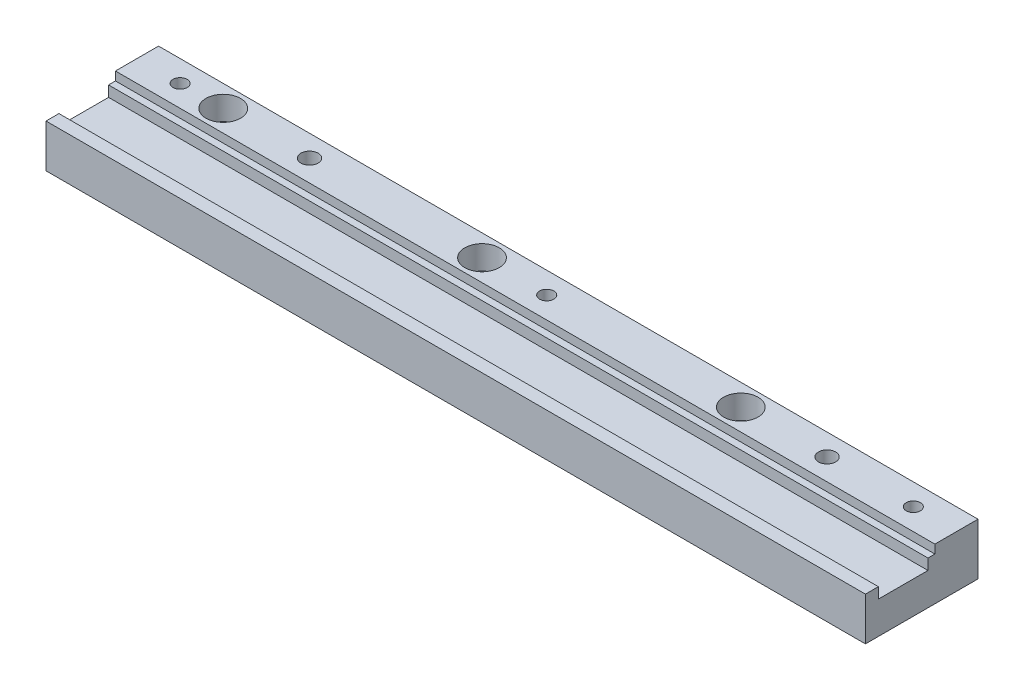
ISO-10303-21;
HEADER;
FILE_DESCRIPTION(('STEP AP214'),'2;1');
FILE_NAME('part.step','',(''),(''),'','','');
FILE_SCHEMA(('AUTOMOTIVE_DESIGN { 1 0 10303 214 1 1 1 1 }'));
ENDSEC;
DATA;
#1=APPLICATION_CONTEXT('core data for automotive mechanical design processes');
#2=APPLICATION_PROTOCOL_DEFINITION('international standard','automotive_design',2000,#1);
#3=PRODUCT_CONTEXT('',#1,'mechanical');
#4=PRODUCT('Part','Part','',(#3));
#5=PRODUCT_RELATED_PRODUCT_CATEGORY('part','',(#4));
#6=PRODUCT_DEFINITION_FORMATION('','',#4);
#7=PRODUCT_DEFINITION_CONTEXT('part definition',#1,'design');
#8=PRODUCT_DEFINITION('design','',#6,#7);
#9=PRODUCT_DEFINITION_SHAPE('','',#8);
#10=(LENGTH_UNIT() NAMED_UNIT(*) SI_UNIT(.MILLI.,.METRE.));
#11=(NAMED_UNIT(*) PLANE_ANGLE_UNIT() SI_UNIT($,.RADIAN.));
#12=(NAMED_UNIT(*) SI_UNIT($,.STERADIAN.) SOLID_ANGLE_UNIT());
#13=UNCERTAINTY_MEASURE_WITH_UNIT(LENGTH_MEASURE(1.E-05),#10,'distance_accuracy_value','');
#14=(GEOMETRIC_REPRESENTATION_CONTEXT(3) GLOBAL_UNCERTAINTY_ASSIGNED_CONTEXT((#13)) GLOBAL_UNIT_ASSIGNED_CONTEXT((#10,
#11,#12)) REPRESENTATION_CONTEXT('',''));
#15=CARTESIAN_POINT('',(0.,0.,0.));
#16=DIRECTION('',(0.,0.,1.));
#17=DIRECTION('',(1.,0.,0.));
#18=AXIS2_PLACEMENT_3D('',#15,#16,#17);
#19=CARTESIAN_POINT('',(80.,-14.0999999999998,5.));
#20=DIRECTION('',(0.,1.,0.));
#21=DIRECTION('',(0.,0.,1.));
#22=AXIS2_PLACEMENT_3D('',#19,#20,#21);
#23=CYLINDRICAL_SURFACE('',#22,2.25);
#24=CARTESIAN_POINT('',(80.,-1.14491749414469E-13,5.));
#25=DIRECTION('',(0.,1.,0.));
#26=DIRECTION('',(0.,0.,1.));
#27=AXIS2_PLACEMENT_3D('',#24,#25,#26);
#28=CIRCLE('',#27,2.25);
#29=CARTESIAN_POINT('',(80.,-1.14491749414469E-13,7.25));
#30=VERTEX_POINT('',#29);
#31=EDGE_CURVE('E119',#30,#30,#28,.T.);
#32=ORIENTED_EDGE('',*,*,#31,.F.);
#33=EDGE_LOOP('',(#32));
#34=FACE_BOUND('',#33,.T.);
#35=CARTESIAN_POINT('',(80.,6.50000000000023,5.));
#36=DIRECTION('',(0.,1.,0.));
#37=DIRECTION('',(0.,0.,1.));
#38=AXIS2_PLACEMENT_3D('',#35,#36,#37);
#39=CIRCLE('',#38,2.25);
#40=CARTESIAN_POINT('',(80.,6.50000000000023,7.25));
#41=VERTEX_POINT('',#40);
#42=EDGE_CURVE('E37',#41,#41,#39,.F.);
#43=ORIENTED_EDGE('',*,*,#42,.F.);
#44=EDGE_LOOP('',(#43));
#45=FACE_BOUND('',#44,.T.);
#46=ADVANCED_FACE('F33',(#34,#45),#23,.F.);
#47=CARTESIAN_POINT('',(20.0000000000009,-14.0999999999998,5.));
#48=DIRECTION('',(0.,1.,0.));
#49=DIRECTION('',(0.,0.,1.));
#50=AXIS2_PLACEMENT_3D('',#47,#48,#49);
#51=CYLINDRICAL_SURFACE('',#50,2.25);
#52=CARTESIAN_POINT('',(20.0000000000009,-1.14491749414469E-13,5.));
#53=DIRECTION('',(0.,1.,0.));
#54=DIRECTION('',(0.,0.,1.));
#55=AXIS2_PLACEMENT_3D('',#52,#53,#54);
#56=CIRCLE('',#55,2.25);
#57=CARTESIAN_POINT('',(20.0000000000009,-1.14491749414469E-13,7.25));
#58=VERTEX_POINT('',#57);
#59=EDGE_CURVE('E116',#58,#58,#56,.T.);
#60=ORIENTED_EDGE('',*,*,#59,.F.);
#61=EDGE_LOOP('',(#60));
#62=FACE_BOUND('',#61,.T.);
#63=CARTESIAN_POINT('',(20.0000000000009,6.50000000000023,5.));
#64=DIRECTION('',(0.,1.,0.));
#65=DIRECTION('',(0.,0.,1.));
#66=AXIS2_PLACEMENT_3D('',#63,#64,#65);
#67=CIRCLE('',#66,2.25);
#68=CARTESIAN_POINT('',(20.0000000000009,6.50000000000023,7.25));
#69=VERTEX_POINT('',#68);
#70=EDGE_CURVE('E145',#69,#69,#67,.F.);
#71=ORIENTED_EDGE('',*,*,#70,.F.);
#72=EDGE_LOOP('',(#71));
#73=FACE_BOUND('',#72,.T.);
#74=ADVANCED_FACE('F294',(#62,#73),#51,.F.);
#75=CARTESIAN_POINT('',(140.,-14.0999999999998,5.));
#76=DIRECTION('',(0.,1.,0.));
#77=DIRECTION('',(0.,0.,1.));
#78=AXIS2_PLACEMENT_3D('',#75,#76,#77);
#79=CYLINDRICAL_SURFACE('',#78,2.25);
#80=CARTESIAN_POINT('',(140.,-1.14491749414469E-13,5.));
#81=DIRECTION('',(0.,1.,0.));
#82=DIRECTION('',(0.,0.,1.));
#83=AXIS2_PLACEMENT_3D('',#80,#81,#82);
#84=CIRCLE('',#83,2.25);
#85=CARTESIAN_POINT('',(140.,-1.14491749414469E-13,7.25));
#86=VERTEX_POINT('',#85);
#87=EDGE_CURVE('E112',#86,#86,#84,.T.);
#88=ORIENTED_EDGE('',*,*,#87,.F.);
#89=EDGE_LOOP('',(#88));
#90=FACE_BOUND('',#89,.T.);
#91=CARTESIAN_POINT('',(140.,6.50000000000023,5.));
#92=DIRECTION('',(0.,1.,0.));
#93=DIRECTION('',(0.,0.,1.));
#94=AXIS2_PLACEMENT_3D('',#91,#92,#93);
#95=CIRCLE('',#94,2.25);
#96=CARTESIAN_POINT('',(140.,6.50000000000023,7.25));
#97=VERTEX_POINT('',#96);
#98=EDGE_CURVE('E142',#97,#97,#95,.F.);
#99=ORIENTED_EDGE('',*,*,#98,.F.);
#100=EDGE_LOOP('',(#99));
#101=FACE_BOUND('',#100,.T.);
#102=ADVANCED_FACE('F300',(#90,#101),#79,.F.);
#103=CARTESIAN_POINT('',(190.,-1.13686837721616E-13,26.1));
#104=DIRECTION('',(-1.,0.,0.));
#105=DIRECTION('',(0.,0.,1.));
#106=AXIS2_PLACEMENT_3D('',#103,#104,#105);
#107=PLANE('',#106);
#108=DIRECTION('',(0.,-1.,0.));
#109=VECTOR('',#108,1.);
#110=CARTESIAN_POINT('',(190.,9.99999999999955,10.));
#111=LINE('',#110,#109);
#112=CARTESIAN_POINT('',(190.,12.,10.));
#113=VERTEX_POINT('',#112);
#114=CARTESIAN_POINT('',(190.,9.99999999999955,10.));
#115=VERTEX_POINT('',#114);
#116=EDGE_CURVE('E199',#113,#115,#111,.T.);
#117=ORIENTED_EDGE('',*,*,#116,.T.);
#118=DIRECTION('',(0.,0.,1.));
#119=VECTOR('',#118,1.);
#120=CARTESIAN_POINT('',(190.,9.99999999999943,11.6000000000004));
#121=LINE('',#120,#119);
#122=CARTESIAN_POINT('',(190.,9.99999999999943,11.6000000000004));
#123=VERTEX_POINT('',#122);
#124=EDGE_CURVE('E202',#115,#123,#121,.T.);
#125=ORIENTED_EDGE('',*,*,#124,.T.);
#126=DIRECTION('',(0.,-1.,0.));
#127=VECTOR('',#126,1.);
#128=CARTESIAN_POINT('',(190.,7.49999999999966,11.6000000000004));
#129=LINE('',#128,#127);
#130=CARTESIAN_POINT('',(190.,7.49999999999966,11.6000000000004));
#131=VERTEX_POINT('',#130);
#132=EDGE_CURVE('E205',#123,#131,#129,.T.);
#133=ORIENTED_EDGE('',*,*,#132,.T.);
#134=DIRECTION('',(0.,0.,1.));
#135=VECTOR('',#134,1.);
#136=CARTESIAN_POINT('',(190.,7.49999999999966,23.1000000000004));
#137=LINE('',#136,#135);
#138=CARTESIAN_POINT('',(190.,7.49999999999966,23.1000000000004));
#139=VERTEX_POINT('',#138);
#140=EDGE_CURVE('E179',#131,#139,#137,.T.);
#141=ORIENTED_EDGE('',*,*,#140,.T.);
#142=DIRECTION('',(0.,1.,0.));
#143=VECTOR('',#142,1.);
#144=CARTESIAN_POINT('',(190.,7.49999999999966,23.1000000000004));
#145=LINE('',#144,#143);
#146=CARTESIAN_POINT('',(190.,10.,23.1000000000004));
#147=VERTEX_POINT('',#146);
#148=EDGE_CURVE('E115',#139,#147,#145,.T.);
#149=ORIENTED_EDGE('',*,*,#148,.T.);
#150=DIRECTION('',(0.,0.,1.));
#151=VECTOR('',#150,1.);
#152=CARTESIAN_POINT('',(190.,10.,26.1000000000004));
#153=LINE('',#152,#151);
#154=CARTESIAN_POINT('',(190.,10.,26.1000000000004));
#155=VERTEX_POINT('',#154);
#156=EDGE_CURVE('E196',#147,#155,#153,.T.);
#157=ORIENTED_EDGE('',*,*,#156,.T.);
#158=DIRECTION('',(0.,1.,0.));
#159=VECTOR('',#158,1.);
#160=CARTESIAN_POINT('',(190.,-1.13686837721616E-13,26.1));
#161=LINE('',#160,#159);
#162=CARTESIAN_POINT('',(190.,-1.13686837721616E-13,26.1));
#163=VERTEX_POINT('',#162);
#164=EDGE_CURVE('E225',#163,#155,#161,.T.);
#165=ORIENTED_EDGE('',*,*,#164,.F.);
#166=DIRECTION('',(0.,0.,-1.));
#167=VECTOR('',#166,1.);
#168=CARTESIAN_POINT('',(190.,-1.13686837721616E-13,26.1));
#169=LINE('',#168,#167);
#170=CARTESIAN_POINT('',(190.,-1.13686837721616E-13,0.));
#171=VERTEX_POINT('',#170);
#172=EDGE_CURVE('E12',#163,#171,#169,.T.);
#173=ORIENTED_EDGE('',*,*,#172,.T.);
#174=DIRECTION('',(0.,1.,0.));
#175=VECTOR('',#174,1.);
#176=CARTESIAN_POINT('',(190.,-1.13686837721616E-13,0.));
#177=LINE('',#176,#175);
#178=CARTESIAN_POINT('',(190.,12.0000000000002,0.));
#179=VERTEX_POINT('',#178);
#180=EDGE_CURVE('E99',#171,#179,#177,.T.);
#181=ORIENTED_EDGE('',*,*,#180,.T.);
#182=DIRECTION('',(0.,0.,-1.));
#183=VECTOR('',#182,1.);
#184=CARTESIAN_POINT('',(190.,12.0000000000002,26.1));
#185=LINE('',#184,#183);
#186=EDGE_CURVE('E42',#113,#179,#185,.T.);
#187=ORIENTED_EDGE('',*,*,#186,.F.);
#188=EDGE_LOOP('',(#117,#125,#133,#141,#149,#157,#165,#173,#181,#187));
#189=FACE_BOUND('',#188,.T.);
#190=ADVANCED_FACE('F232',(#189),#107,.F.);
#191=CARTESIAN_POINT('',(0.,12.0000000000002,26.1));
#192=DIRECTION('',(0.,-1.,0.));
#193=DIRECTION('',(0.,0.,-1.));
#194=AXIS2_PLACEMENT_3D('',#191,#192,#193);
#195=PLANE('',#194);
#196=CARTESIAN_POINT('',(80.,12.0000000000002,5.));
#197=DIRECTION('',(0.,1.,0.));
#198=DIRECTION('',(0.,0.,1.));
#199=AXIS2_PLACEMENT_3D('',#196,#197,#198);
#200=CIRCLE('',#199,4.);
#201=CARTESIAN_POINT('',(80.,12.0000000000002,9.00000000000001));
#202=VERTEX_POINT('',#201);
#203=EDGE_CURVE('E161',#202,#202,#200,.T.);
#204=ORIENTED_EDGE('',*,*,#203,.F.);
#205=EDGE_LOOP('',(#204));
#206=FACE_BOUND('',#205,.T.);
#207=CARTESIAN_POINT('',(20.0000000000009,12.0000000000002,5.));
#208=DIRECTION('',(0.,1.,0.));
#209=DIRECTION('',(0.,0.,1.));
#210=AXIS2_PLACEMENT_3D('',#207,#208,#209);
#211=CIRCLE('',#210,4.);
#212=CARTESIAN_POINT('',(20.0000000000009,12.0000000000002,9.));
#213=VERTEX_POINT('',#212);
#214=EDGE_CURVE('E154',#213,#213,#211,.T.);
#215=ORIENTED_EDGE('',*,*,#214,.F.);
#216=EDGE_LOOP('',(#215));
#217=FACE_BOUND('',#216,.T.);
#218=CARTESIAN_POINT('',(140.,12.0000000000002,5.));
#219=DIRECTION('',(0.,1.,0.));
#220=DIRECTION('',(0.,0.,1.));
#221=AXIS2_PLACEMENT_3D('',#218,#219,#220);
#222=CIRCLE('',#221,4.);
#223=CARTESIAN_POINT('',(140.,12.0000000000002,9.00000000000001));
#224=VERTEX_POINT('',#223);
#225=EDGE_CURVE('E147',#224,#224,#222,.T.);
#226=ORIENTED_EDGE('',*,*,#225,.F.);
#227=EDGE_LOOP('',(#226));
#228=FACE_BOUND('',#227,.T.);
#229=CARTESIAN_POINT('',(40.,12.0000000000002,5.));
#230=DIRECTION('',(0.,1.,0.));
#231=DIRECTION('',(0.,0.,1.));
#232=AXIS2_PLACEMENT_3D('',#229,#230,#231);
#233=CIRCLE('',#232,2.00000000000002);
#234=CARTESIAN_POINT('',(40.,12.0000000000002,7.00000000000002));
#235=VERTEX_POINT('',#234);
#236=EDGE_CURVE('E141',#235,#235,#233,.T.);
#237=ORIENTED_EDGE('',*,*,#236,.F.);
#238=EDGE_LOOP('',(#237));
#239=FACE_BOUND('',#238,.T.);
#240=CARTESIAN_POINT('',(160.,12.0000000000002,5.));
#241=DIRECTION('',(0.,1.,0.));
#242=DIRECTION('',(0.,0.,1.));
#243=AXIS2_PLACEMENT_3D('',#240,#241,#242);
#244=CIRCLE('',#243,2.00000000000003);
#245=CARTESIAN_POINT('',(160.,12.0000000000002,7.00000000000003));
#246=VERTEX_POINT('',#245);
#247=EDGE_CURVE('E137',#246,#246,#244,.T.);
#248=ORIENTED_EDGE('',*,*,#247,.F.);
#249=EDGE_LOOP('',(#248));
#250=FACE_BOUND('',#249,.T.);
#251=CARTESIAN_POINT('',(180.000000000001,12.0000000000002,5.));
#252=DIRECTION('',(0.,1.,0.));
#253=DIRECTION('',(0.,0.,1.));
#254=AXIS2_PLACEMENT_3D('',#251,#252,#253);
#255=CIRCLE('',#254,1.65000000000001);
#256=CARTESIAN_POINT('',(180.000000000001,12.0000000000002,6.65000000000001));
#257=VERTEX_POINT('',#256);
#258=EDGE_CURVE('E133',#257,#257,#255,.T.);
#259=ORIENTED_EDGE('',*,*,#258,.F.);
#260=EDGE_LOOP('',(#259));
#261=FACE_BOUND('',#260,.T.);
#262=CARTESIAN_POINT('',(95.,12.0000000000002,5.));
#263=DIRECTION('',(0.,1.,0.));
#264=DIRECTION('',(0.,0.,1.));
#265=AXIS2_PLACEMENT_3D('',#262,#263,#264);
#266=CIRCLE('',#265,1.65);
#267=CARTESIAN_POINT('',(95.,12.0000000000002,6.65));
#268=VERTEX_POINT('',#267);
#269=EDGE_CURVE('E129',#268,#268,#266,.T.);
#270=ORIENTED_EDGE('',*,*,#269,.F.);
#271=EDGE_LOOP('',(#270));
#272=FACE_BOUND('',#271,.T.);
#273=CARTESIAN_POINT('',(10.0000000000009,12.0000000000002,5.));
#274=DIRECTION('',(0.,1.,0.));
#275=DIRECTION('',(0.,0.,1.));
#276=AXIS2_PLACEMENT_3D('',#273,#274,#275);
#277=CIRCLE('',#276,1.65);
#278=CARTESIAN_POINT('',(10.0000000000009,12.0000000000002,6.65));
#279=VERTEX_POINT('',#278);
#280=EDGE_CURVE('E125',#279,#279,#277,.T.);
#281=ORIENTED_EDGE('',*,*,#280,.F.);
#282=EDGE_LOOP('',(#281));
#283=FACE_BOUND('',#282,.T.);
#284=DIRECTION('',(1.,0.,0.));
#285=VECTOR('',#284,1.);
#286=CARTESIAN_POINT('',(0.,12.,10.));
#287=LINE('',#286,#285);
#288=CARTESIAN_POINT('',(0.,12.,10.));
#289=VERTEX_POINT('',#288);
#290=EDGE_CURVE('E218',#289,#113,#287,.T.);
#291=ORIENTED_EDGE('',*,*,#290,.T.);
#292=ORIENTED_EDGE('',*,*,#186,.T.);
#293=DIRECTION('',(-1.,0.,0.));
#294=VECTOR('',#293,1.);
#295=CARTESIAN_POINT('',(0.,12.0000000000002,0.));
#296=LINE('',#295,#294);
#297=CARTESIAN_POINT('',(0.,12.0000000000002,0.));
#298=VERTEX_POINT('',#297);
#299=EDGE_CURVE('E90',#179,#298,#296,.T.);
#300=ORIENTED_EDGE('',*,*,#299,.T.);
#301=DIRECTION('',(0.,0.,-1.));
#302=VECTOR('',#301,1.);
#303=CARTESIAN_POINT('',(0.,12.0000000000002,26.1));
#304=LINE('',#303,#302);
#305=EDGE_CURVE('E84',#289,#298,#304,.T.);
#306=ORIENTED_EDGE('',*,*,#305,.F.);
#307=EDGE_LOOP('',(#291,#292,#300,#306));
#308=FACE_BOUND('',#307,.T.);
#309=ADVANCED_FACE('F270',(#206,#217,#228,#239,#250,#261,#272,#283,#308),#195,.F.);
#310=CARTESIAN_POINT('',(0.,-1.13686837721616E-13,26.1));
#311=DIRECTION('',(1.,0.,0.));
#312=DIRECTION('',(0.,0.,-1.));
#313=AXIS2_PLACEMENT_3D('',#310,#311,#312);
#314=PLANE('',#313);
#315=DIRECTION('',(0.,-1.,0.));
#316=VECTOR('',#315,1.);
#317=CARTESIAN_POINT('',(0.,9.99999999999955,10.));
#318=LINE('',#317,#316);
#319=CARTESIAN_POINT('',(0.,9.99999999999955,10.));
#320=VERTEX_POINT('',#319);
#321=EDGE_CURVE('E181',#289,#320,#318,.T.);
#322=ORIENTED_EDGE('',*,*,#321,.F.);
#323=ORIENTED_EDGE('',*,*,#305,.T.);
#324=DIRECTION('',(0.,-1.,0.));
#325=VECTOR('',#324,1.);
#326=CARTESIAN_POINT('',(0.,-1.13686837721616E-13,0.));
#327=LINE('',#326,#325);
#328=CARTESIAN_POINT('',(0.,-1.13686837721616E-13,0.));
#329=VERTEX_POINT('',#328);
#330=EDGE_CURVE('E77',#298,#329,#327,.T.);
#331=ORIENTED_EDGE('',*,*,#330,.T.);
#332=DIRECTION('',(0.,0.,-1.));
#333=VECTOR('',#332,1.);
#334=CARTESIAN_POINT('',(0.,-1.13686837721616E-13,26.1));
#335=LINE('',#334,#333);
#336=CARTESIAN_POINT('',(0.,-1.13686837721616E-13,26.1));
#337=VERTEX_POINT('',#336);
#338=EDGE_CURVE('E81',#337,#329,#335,.T.);
#339=ORIENTED_EDGE('',*,*,#338,.F.);
#340=DIRECTION('',(0.,-1.,0.));
#341=VECTOR('',#340,1.);
#342=CARTESIAN_POINT('',(0.,-1.13686837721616E-13,26.1));
#343=LINE('',#342,#341);
#344=CARTESIAN_POINT('',(0.,10.,26.1));
#345=VERTEX_POINT('',#344);
#346=EDGE_CURVE('E58',#345,#337,#343,.T.);
#347=ORIENTED_EDGE('',*,*,#346,.F.);
#348=DIRECTION('',(0.,0.,1.));
#349=VECTOR('',#348,1.);
#350=CARTESIAN_POINT('',(0.,10.,26.1000000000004));
#351=LINE('',#350,#349);
#352=CARTESIAN_POINT('',(0.,10.,23.1000000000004));
#353=VERTEX_POINT('',#352);
#354=EDGE_CURVE('E50',#353,#345,#351,.T.);
#355=ORIENTED_EDGE('',*,*,#354,.F.);
#356=DIRECTION('',(0.,1.,0.));
#357=VECTOR('',#356,1.);
#358=CARTESIAN_POINT('',(0.,7.49999999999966,23.1000000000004));
#359=LINE('',#358,#357);
#360=CARTESIAN_POINT('',(0.,7.49999999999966,23.1000000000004));
#361=VERTEX_POINT('',#360);
#362=EDGE_CURVE('E176',#361,#353,#359,.T.);
#363=ORIENTED_EDGE('',*,*,#362,.F.);
#364=DIRECTION('',(0.,0.,1.));
#365=VECTOR('',#364,1.);
#366=CARTESIAN_POINT('',(0.,7.49999999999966,23.1000000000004));
#367=LINE('',#366,#365);
#368=CARTESIAN_POINT('',(0.,7.49999999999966,11.6000000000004));
#369=VERTEX_POINT('',#368);
#370=EDGE_CURVE('E190',#369,#361,#367,.T.);
#371=ORIENTED_EDGE('',*,*,#370,.F.);
#372=DIRECTION('',(0.,-1.,0.));
#373=VECTOR('',#372,1.);
#374=CARTESIAN_POINT('',(0.,7.49999999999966,11.6000000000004));
#375=LINE('',#374,#373);
#376=CARTESIAN_POINT('',(0.,9.99999999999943,11.6000000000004));
#377=VERTEX_POINT('',#376);
#378=EDGE_CURVE('E187',#377,#369,#375,.T.);
#379=ORIENTED_EDGE('',*,*,#378,.F.);
#380=DIRECTION('',(0.,0.,1.));
#381=VECTOR('',#380,1.);
#382=CARTESIAN_POINT('',(0.,9.99999999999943,11.6000000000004));
#383=LINE('',#382,#381);
#384=EDGE_CURVE('E184',#320,#377,#383,.T.);
#385=ORIENTED_EDGE('',*,*,#384,.F.);
#386=EDGE_LOOP('',(#322,#323,#331,#339,#347,#355,#363,#371,#379,#385));
#387=FACE_BOUND('',#386,.T.);
#388=ADVANCED_FACE('F80',(#387),#314,.F.);
#389=CARTESIAN_POINT('',(190.,-1.13686837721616E-13,26.1));
#390=DIRECTION('',(0.,0.,1.));
#391=DIRECTION('',(1.,0.,0.));
#392=AXIS2_PLACEMENT_3D('',#389,#390,#391);
#393=PLANE('',#392);
#394=ORIENTED_EDGE('',*,*,#164,.T.);
#395=DIRECTION('',(1.,0.,0.));
#396=VECTOR('',#395,1.);
#397=CARTESIAN_POINT('',(0.,10.,26.1000000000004));
#398=LINE('',#397,#396);
#399=EDGE_CURVE('E221',#345,#155,#398,.T.);
#400=ORIENTED_EDGE('',*,*,#399,.F.);
#401=ORIENTED_EDGE('',*,*,#346,.T.);
#402=DIRECTION('',(1.,0.,0.));
#403=VECTOR('',#402,1.);
#404=CARTESIAN_POINT('',(0.,-1.13686837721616E-13,26.1));
#405=LINE('',#404,#403);
#406=EDGE_CURVE('E89',#337,#163,#405,.T.);
#407=ORIENTED_EDGE('',*,*,#406,.T.);
#408=EDGE_LOOP('',(#394,#400,#401,#407));
#409=FACE_BOUND('',#408,.T.);
#410=ADVANCED_FACE('F228',(#409),#393,.T.);
#411=CARTESIAN_POINT('',(0.,-1.13686837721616E-13,26.1));
#412=DIRECTION('',(0.,1.,0.));
#413=DIRECTION('',(0.,0.,1.));
#414=AXIS2_PLACEMENT_3D('',#411,#412,#413);
#415=PLANE('',#414);
#416=CARTESIAN_POINT('',(40.,-1.14491749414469E-13,5.));
#417=DIRECTION('',(0.,1.,0.));
#418=DIRECTION('',(0.,0.,1.));
#419=AXIS2_PLACEMENT_3D('',#416,#417,#418);
#420=CIRCLE('',#419,2.00000000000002);
#421=CARTESIAN_POINT('',(40.,-1.14491749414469E-13,7.00000000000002));
#422=VERTEX_POINT('',#421);
#423=EDGE_CURVE('E138',#422,#422,#420,.T.);
#424=ORIENTED_EDGE('',*,*,#423,.T.);
#425=EDGE_LOOP('',(#424));
#426=FACE_BOUND('',#425,.T.);
#427=CARTESIAN_POINT('',(160.,-1.14491749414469E-13,5.));
#428=DIRECTION('',(0.,1.,0.));
#429=DIRECTION('',(0.,0.,1.));
#430=AXIS2_PLACEMENT_3D('',#427,#428,#429);
#431=CIRCLE('',#430,2.00000000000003);
#432=CARTESIAN_POINT('',(160.,-1.14491749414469E-13,7.00000000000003));
#433=VERTEX_POINT('',#432);
#434=EDGE_CURVE('E134',#433,#433,#431,.T.);
#435=ORIENTED_EDGE('',*,*,#434,.T.);
#436=EDGE_LOOP('',(#435));
#437=FACE_BOUND('',#436,.T.);
#438=CARTESIAN_POINT('',(180.000000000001,-1.14491749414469E-13,5.));
#439=DIRECTION('',(0.,1.,0.));
#440=DIRECTION('',(0.,0.,1.));
#441=AXIS2_PLACEMENT_3D('',#438,#439,#440);
#442=CIRCLE('',#441,1.65000000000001);
#443=CARTESIAN_POINT('',(180.000000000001,-1.14491749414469E-13,6.65000000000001));
#444=VERTEX_POINT('',#443);
#445=EDGE_CURVE('E130',#444,#444,#442,.T.);
#446=ORIENTED_EDGE('',*,*,#445,.T.);
#447=EDGE_LOOP('',(#446));
#448=FACE_BOUND('',#447,.T.);
#449=CARTESIAN_POINT('',(95.,-1.14491749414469E-13,5.));
#450=DIRECTION('',(0.,1.,0.));
#451=DIRECTION('',(0.,0.,1.));
#452=AXIS2_PLACEMENT_3D('',#449,#450,#451);
#453=CIRCLE('',#452,1.65);
#454=CARTESIAN_POINT('',(95.,-1.14491749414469E-13,6.65));
#455=VERTEX_POINT('',#454);
#456=EDGE_CURVE('E126',#455,#455,#453,.T.);
#457=ORIENTED_EDGE('',*,*,#456,.T.);
#458=EDGE_LOOP('',(#457));
#459=FACE_BOUND('',#458,.T.);
#460=CARTESIAN_POINT('',(10.0000000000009,-1.14491749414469E-13,5.));
#461=DIRECTION('',(0.,1.,0.));
#462=DIRECTION('',(0.,0.,1.));
#463=AXIS2_PLACEMENT_3D('',#460,#461,#462);
#464=CIRCLE('',#463,1.65);
#465=CARTESIAN_POINT('',(10.0000000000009,-1.14491749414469E-13,6.65));
#466=VERTEX_POINT('',#465);
#467=EDGE_CURVE('E122',#466,#466,#464,.T.);
#468=ORIENTED_EDGE('',*,*,#467,.T.);
#469=EDGE_LOOP('',(#468));
#470=FACE_BOUND('',#469,.T.);
#471=ORIENTED_EDGE('',*,*,#31,.T.);
#472=EDGE_LOOP('',(#471));
#473=FACE_BOUND('',#472,.T.);
#474=ORIENTED_EDGE('',*,*,#59,.T.);
#475=EDGE_LOOP('',(#474));
#476=FACE_BOUND('',#475,.T.);
#477=ORIENTED_EDGE('',*,*,#87,.T.);
#478=EDGE_LOOP('',(#477));
#479=FACE_BOUND('',#478,.T.);
#480=DIRECTION('',(1.,0.,0.));
#481=VECTOR('',#480,1.);
#482=CARTESIAN_POINT('',(0.,-1.13686837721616E-13,0.));
#483=LINE('',#482,#481);
#484=EDGE_CURVE('E95',#329,#171,#483,.T.);
#485=ORIENTED_EDGE('',*,*,#484,.T.);
#486=ORIENTED_EDGE('',*,*,#172,.F.);
#487=ORIENTED_EDGE('',*,*,#406,.F.);
#488=ORIENTED_EDGE('',*,*,#338,.T.);
#489=EDGE_LOOP('',(#485,#486,#487,#488));
#490=FACE_BOUND('',#489,.T.);
#491=ADVANCED_FACE('F35',(#426,#437,#448,#459,#470,#473,#476,#479,#490),#415,.F.);
#492=CARTESIAN_POINT('',(190.,-1.13686837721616E-13,0.));
#493=DIRECTION('',(0.,0.,1.));
#494=DIRECTION('',(1.,0.,0.));
#495=AXIS2_PLACEMENT_3D('',#492,#493,#494);
#496=PLANE('',#495);
#497=ORIENTED_EDGE('',*,*,#484,.F.);
#498=ORIENTED_EDGE('',*,*,#330,.F.);
#499=ORIENTED_EDGE('',*,*,#299,.F.);
#500=ORIENTED_EDGE('',*,*,#180,.F.);
#501=EDGE_LOOP('',(#497,#498,#499,#500));
#502=FACE_BOUND('',#501,.T.);
#503=ADVANCED_FACE('F97',(#502),#496,.F.);
#504=CARTESIAN_POINT('',(0.,7.49999999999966,23.1000000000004));
#505=DIRECTION('',(0.,0.,-1.));
#506=DIRECTION('',(-1.,0.,0.));
#507=AXIS2_PLACEMENT_3D('',#504,#505,#506);
#508=PLANE('',#507);
#509=ORIENTED_EDGE('',*,*,#148,.F.);
#510=DIRECTION('',(1.,0.,0.));
#511=VECTOR('',#510,1.);
#512=CARTESIAN_POINT('',(0.,7.49999999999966,23.1000000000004));
#513=LINE('',#512,#511);
#514=EDGE_CURVE('E100',#361,#139,#513,.T.);
#515=ORIENTED_EDGE('',*,*,#514,.F.);
#516=ORIENTED_EDGE('',*,*,#362,.T.);
#517=DIRECTION('',(1.,0.,0.));
#518=VECTOR('',#517,1.);
#519=CARTESIAN_POINT('',(0.,10.,23.1000000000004));
#520=LINE('',#519,#518);
#521=EDGE_CURVE('E193',#353,#147,#520,.T.);
#522=ORIENTED_EDGE('',*,*,#521,.T.);
#523=EDGE_LOOP('',(#509,#515,#516,#522));
#524=FACE_BOUND('',#523,.T.);
#525=ADVANCED_FACE('F282',(#524),#508,.T.);
#526=CARTESIAN_POINT('',(0.,7.49999999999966,23.1000000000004));
#527=DIRECTION('',(0.,1.,0.));
#528=DIRECTION('',(0.,0.,1.));
#529=AXIS2_PLACEMENT_3D('',#526,#527,#528);
#530=PLANE('',#529);
#531=ORIENTED_EDGE('',*,*,#140,.F.);
#532=DIRECTION('',(1.,0.,0.));
#533=VECTOR('',#532,1.);
#534=CARTESIAN_POINT('',(0.,7.49999999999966,11.6000000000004));
#535=LINE('',#534,#533);
#536=EDGE_CURVE('E104',#369,#131,#535,.T.);
#537=ORIENTED_EDGE('',*,*,#536,.F.);
#538=ORIENTED_EDGE('',*,*,#370,.T.);
#539=ORIENTED_EDGE('',*,*,#514,.T.);
#540=EDGE_LOOP('',(#531,#537,#538,#539));
#541=FACE_BOUND('',#540,.T.);
#542=ADVANCED_FACE('F280',(#541),#530,.T.);
#543=CARTESIAN_POINT('',(0.,7.49999999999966,11.6000000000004));
#544=DIRECTION('',(0.,0.,1.));
#545=DIRECTION('',(1.,0.,0.));
#546=AXIS2_PLACEMENT_3D('',#543,#544,#545);
#547=PLANE('',#546);
#548=ORIENTED_EDGE('',*,*,#132,.F.);
#549=DIRECTION('',(1.,0.,0.));
#550=VECTOR('',#549,1.);
#551=CARTESIAN_POINT('',(0.,9.99999999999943,11.6000000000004));
#552=LINE('',#551,#550);
#553=EDGE_CURVE('E212',#377,#123,#552,.T.);
#554=ORIENTED_EDGE('',*,*,#553,.F.);
#555=ORIENTED_EDGE('',*,*,#378,.T.);
#556=ORIENTED_EDGE('',*,*,#536,.T.);
#557=EDGE_LOOP('',(#548,#554,#555,#556));
#558=FACE_BOUND('',#557,.T.);
#559=ADVANCED_FACE('F276',(#558),#547,.T.);
#560=CARTESIAN_POINT('',(0.,9.99999999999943,11.6000000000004));
#561=DIRECTION('',(0.,1.,0.));
#562=DIRECTION('',(0.,0.,1.));
#563=AXIS2_PLACEMENT_3D('',#560,#561,#562);
#564=PLANE('',#563);
#565=ORIENTED_EDGE('',*,*,#124,.F.);
#566=DIRECTION('',(1.,0.,0.));
#567=VECTOR('',#566,1.);
#568=CARTESIAN_POINT('',(0.,9.99999999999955,10.));
#569=LINE('',#568,#567);
#570=EDGE_CURVE('E215',#320,#115,#569,.T.);
#571=ORIENTED_EDGE('',*,*,#570,.F.);
#572=ORIENTED_EDGE('',*,*,#384,.T.);
#573=ORIENTED_EDGE('',*,*,#553,.T.);
#574=EDGE_LOOP('',(#565,#571,#572,#573));
#575=FACE_BOUND('',#574,.T.);
#576=ADVANCED_FACE('F274',(#575),#564,.T.);
#577=CARTESIAN_POINT('',(0.,9.99999999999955,10.));
#578=DIRECTION('',(0.,0.,1.));
#579=DIRECTION('',(1.,0.,0.));
#580=AXIS2_PLACEMENT_3D('',#577,#578,#579);
#581=PLANE('',#580);
#582=ORIENTED_EDGE('',*,*,#116,.F.);
#583=ORIENTED_EDGE('',*,*,#290,.F.);
#584=ORIENTED_EDGE('',*,*,#321,.T.);
#585=ORIENTED_EDGE('',*,*,#570,.T.);
#586=EDGE_LOOP('',(#582,#583,#584,#585));
#587=FACE_BOUND('',#586,.T.);
#588=ADVANCED_FACE('F265',(#587),#581,.T.);
#589=CARTESIAN_POINT('',(0.,10.,26.1000000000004));
#590=DIRECTION('',(0.,1.,0.));
#591=DIRECTION('',(0.,0.,1.));
#592=AXIS2_PLACEMENT_3D('',#589,#590,#591);
#593=PLANE('',#592);
#594=ORIENTED_EDGE('',*,*,#156,.F.);
#595=ORIENTED_EDGE('',*,*,#521,.F.);
#596=ORIENTED_EDGE('',*,*,#354,.T.);
#597=ORIENTED_EDGE('',*,*,#399,.T.);
#598=EDGE_LOOP('',(#594,#595,#596,#597));
#599=FACE_BOUND('',#598,.T.);
#600=ADVANCED_FACE('F235',(#599),#593,.T.);
#601=CARTESIAN_POINT('',(10.0000000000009,-14.0999999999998,5.));
#602=DIRECTION('',(0.,1.,0.));
#603=DIRECTION('',(0.,0.,1.));
#604=AXIS2_PLACEMENT_3D('',#601,#602,#603);
#605=CYLINDRICAL_SURFACE('',#604,1.65);
#606=ORIENTED_EDGE('',*,*,#280,.T.);
#607=EDGE_LOOP('',(#606));
#608=FACE_BOUND('',#607,.T.);
#609=ORIENTED_EDGE('',*,*,#467,.F.);
#610=EDGE_LOOP('',(#609));
#611=FACE_BOUND('',#610,.T.);
#612=ADVANCED_FACE('F306',(#608,#611),#605,.F.);
#613=CARTESIAN_POINT('',(95.,-14.0999999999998,5.));
#614=DIRECTION('',(0.,1.,0.));
#615=DIRECTION('',(0.,0.,1.));
#616=AXIS2_PLACEMENT_3D('',#613,#614,#615);
#617=CYLINDRICAL_SURFACE('',#616,1.65);
#618=ORIENTED_EDGE('',*,*,#269,.T.);
#619=EDGE_LOOP('',(#618));
#620=FACE_BOUND('',#619,.T.);
#621=ORIENTED_EDGE('',*,*,#456,.F.);
#622=EDGE_LOOP('',(#621));
#623=FACE_BOUND('',#622,.T.);
#624=ADVANCED_FACE('F321',(#620,#623),#617,.F.);
#625=CARTESIAN_POINT('',(180.000000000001,-14.0999999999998,5.));
#626=DIRECTION('',(0.,1.,0.));
#627=DIRECTION('',(0.,0.,1.));
#628=AXIS2_PLACEMENT_3D('',#625,#626,#627);
#629=CYLINDRICAL_SURFACE('',#628,1.65000000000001);
#630=ORIENTED_EDGE('',*,*,#258,.T.);
#631=EDGE_LOOP('',(#630));
#632=FACE_BOUND('',#631,.T.);
#633=ORIENTED_EDGE('',*,*,#445,.F.);
#634=EDGE_LOOP('',(#633));
#635=FACE_BOUND('',#634,.T.);
#636=ADVANCED_FACE('F326',(#632,#635),#629,.F.);
#637=CARTESIAN_POINT('',(160.,-14.0999999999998,5.));
#638=DIRECTION('',(0.,1.,0.));
#639=DIRECTION('',(0.,0.,1.));
#640=AXIS2_PLACEMENT_3D('',#637,#638,#639);
#641=CYLINDRICAL_SURFACE('',#640,2.00000000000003);
#642=ORIENTED_EDGE('',*,*,#247,.T.);
#643=EDGE_LOOP('',(#642));
#644=FACE_BOUND('',#643,.T.);
#645=ORIENTED_EDGE('',*,*,#434,.F.);
#646=EDGE_LOOP('',(#645));
#647=FACE_BOUND('',#646,.T.);
#648=ADVANCED_FACE('F355',(#644,#647),#641,.F.);
#649=CARTESIAN_POINT('',(40.,-14.0999999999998,5.));
#650=DIRECTION('',(0.,1.,0.));
#651=DIRECTION('',(0.,0.,1.));
#652=AXIS2_PLACEMENT_3D('',#649,#650,#651);
#653=CYLINDRICAL_SURFACE('',#652,2.00000000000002);
#654=ORIENTED_EDGE('',*,*,#236,.T.);
#655=EDGE_LOOP('',(#654));
#656=FACE_BOUND('',#655,.T.);
#657=ORIENTED_EDGE('',*,*,#423,.F.);
#658=EDGE_LOOP('',(#657));
#659=FACE_BOUND('',#658,.T.);
#660=ADVANCED_FACE('F345',(#656,#659),#653,.F.);
#661=CARTESIAN_POINT('',(140.,6.50000000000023,5.));
#662=DIRECTION('',(0.,1.,0.));
#663=DIRECTION('',(0.,0.,1.));
#664=AXIS2_PLACEMENT_3D('',#661,#662,#663);
#665=PLANE('',#664);
#666=CARTESIAN_POINT('',(140.,6.50000000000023,5.));
#667=DIRECTION('',(0.,1.,0.));
#668=DIRECTION('',(0.,0.,1.));
#669=AXIS2_PLACEMENT_3D('',#666,#667,#668);
#670=CIRCLE('',#669,4.);
#671=CARTESIAN_POINT('',(140.,6.50000000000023,9.00000000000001));
#672=VERTEX_POINT('',#671);
#673=EDGE_CURVE('E144',#672,#672,#670,.T.);
#674=ORIENTED_EDGE('',*,*,#673,.T.);
#675=EDGE_LOOP('',(#674));
#676=FACE_BOUND('',#675,.T.);
#677=ORIENTED_EDGE('',*,*,#98,.T.);
#678=EDGE_LOOP('',(#677));
#679=FACE_BOUND('',#678,.T.);
#680=ADVANCED_FACE('F342',(#676,#679),#665,.T.);
#681=CARTESIAN_POINT('',(140.,6.50000000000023,5.));
#682=DIRECTION('',(0.,1.,0.));
#683=DIRECTION('',(0.,0.,1.));
#684=AXIS2_PLACEMENT_3D('',#681,#682,#683);
#685=CYLINDRICAL_SURFACE('',#684,4.);
#686=ORIENTED_EDGE('',*,*,#673,.F.);
#687=EDGE_LOOP('',(#686));
#688=FACE_BOUND('',#687,.T.);
#689=ORIENTED_EDGE('',*,*,#225,.T.);
#690=EDGE_LOOP('',(#689));
#691=FACE_BOUND('',#690,.T.);
#692=ADVANCED_FACE('F344',(#688,#691),#685,.F.);
#693=CARTESIAN_POINT('',(20.0000000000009,6.50000000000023,5.));
#694=DIRECTION('',(0.,1.,0.));
#695=DIRECTION('',(0.,0.,1.));
#696=AXIS2_PLACEMENT_3D('',#693,#694,#695);
#697=PLANE('',#696);
#698=CARTESIAN_POINT('',(20.0000000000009,6.50000000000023,5.));
#699=DIRECTION('',(0.,1.,0.));
#700=DIRECTION('',(0.,0.,1.));
#701=AXIS2_PLACEMENT_3D('',#698,#699,#700);
#702=CIRCLE('',#701,4.);
#703=CARTESIAN_POINT('',(20.0000000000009,6.50000000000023,9.));
#704=VERTEX_POINT('',#703);
#705=EDGE_CURVE('E148',#704,#704,#702,.T.);
#706=ORIENTED_EDGE('',*,*,#705,.T.);
#707=EDGE_LOOP('',(#706));
#708=FACE_BOUND('',#707,.T.);
#709=ORIENTED_EDGE('',*,*,#70,.T.);
#710=EDGE_LOOP('',(#709));
#711=FACE_BOUND('',#710,.T.);
#712=ADVANCED_FACE('F352',(#708,#711),#697,.T.);
#713=CARTESIAN_POINT('',(20.0000000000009,6.50000000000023,5.));
#714=DIRECTION('',(0.,1.,0.));
#715=DIRECTION('',(0.,0.,1.));
#716=AXIS2_PLACEMENT_3D('',#713,#714,#715);
#717=CYLINDRICAL_SURFACE('',#716,4.);
#718=ORIENTED_EDGE('',*,*,#705,.F.);
#719=EDGE_LOOP('',(#718));
#720=FACE_BOUND('',#719,.T.);
#721=ORIENTED_EDGE('',*,*,#214,.T.);
#722=EDGE_LOOP('',(#721));
#723=FACE_BOUND('',#722,.T.);
#724=ADVANCED_FACE('F359',(#720,#723),#717,.F.);
#725=CARTESIAN_POINT('',(80.,6.50000000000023,5.));
#726=DIRECTION('',(0.,1.,0.));
#727=DIRECTION('',(0.,0.,1.));
#728=AXIS2_PLACEMENT_3D('',#725,#726,#727);
#729=PLANE('',#728);
#730=CARTESIAN_POINT('',(80.,6.50000000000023,5.));
#731=DIRECTION('',(0.,1.,0.));
#732=DIRECTION('',(0.,0.,1.));
#733=AXIS2_PLACEMENT_3D('',#730,#731,#732);
#734=CIRCLE('',#733,4.);
#735=CARTESIAN_POINT('',(80.,6.50000000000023,9.00000000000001));
#736=VERTEX_POINT('',#735);
#737=EDGE_CURVE('E477',#736,#736,#734,.T.);
#738=ORIENTED_EDGE('',*,*,#737,.T.);
#739=EDGE_LOOP('',(#738));
#740=FACE_BOUND('',#739,.T.);
#741=ORIENTED_EDGE('',*,*,#42,.T.);
#742=EDGE_LOOP('',(#741));
#743=FACE_BOUND('',#742,.T.);
#744=ADVANCED_FACE('F451',(#740,#743),#729,.T.);
#745=CARTESIAN_POINT('',(80.,6.50000000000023,5.));
#746=DIRECTION('',(0.,1.,0.));
#747=DIRECTION('',(0.,0.,1.));
#748=AXIS2_PLACEMENT_3D('',#745,#746,#747);
#749=CYLINDRICAL_SURFACE('',#748,4.);
#750=ORIENTED_EDGE('',*,*,#737,.F.);
#751=EDGE_LOOP('',(#750));
#752=FACE_BOUND('',#751,.T.);
#753=ORIENTED_EDGE('',*,*,#203,.T.);
#754=EDGE_LOOP('',(#753));
#755=FACE_BOUND('',#754,.T.);
#756=ADVANCED_FACE('F460',(#752,#755),#749,.F.);
#757=CLOSED_SHELL('',(#46,#74,#102,#190,#309,#388,#410,#491,#503,#525,#542,#559,#576,#588,#600,
#612,#624,#636,#648,#660,#680,#692,#712,#724,#744,#756));
#758=MANIFOLD_SOLID_BREP('B2',#757);
#759=ADVANCED_BREP_SHAPE_REPRESENTATION('',(#18,#758),#14);
#760=SHAPE_DEFINITION_REPRESENTATION(#9,#759);
ENDSEC;
END-ISO-10303-21;
